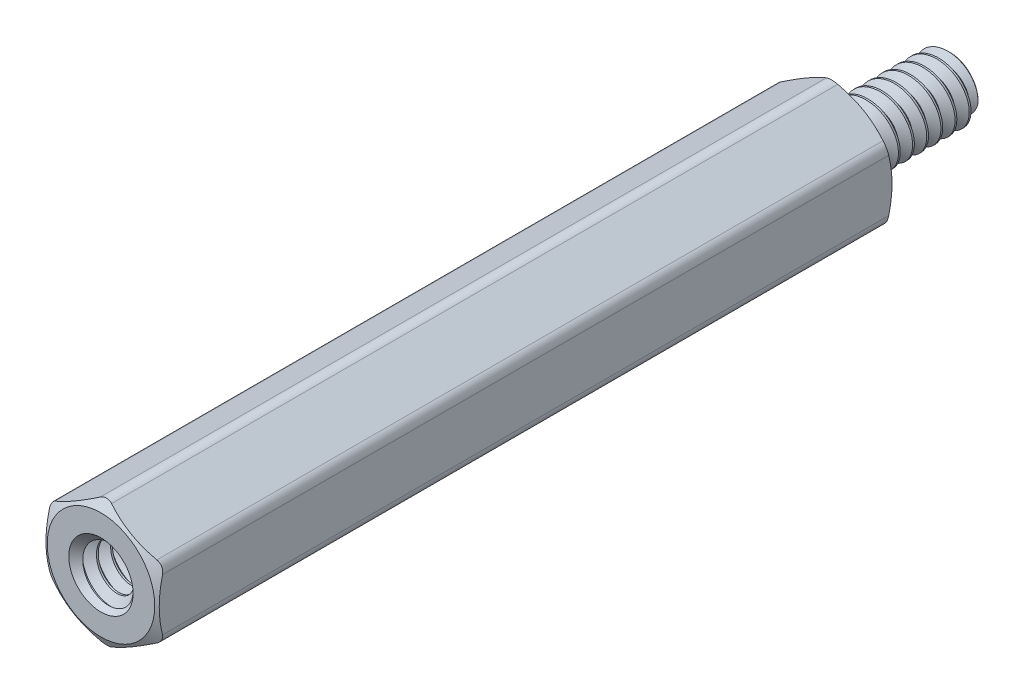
from build123d import *

# Parameters (mm, degrees)
SKETCH4_R              = 2.4638
BOSS_EXTRUDE1_DEPTH    = 41.275
SKETCH5_OUTSIDE_W      = 187.366
SKETCH5_OUTSIDE_H      = 188.348
SKETCH5_OUTSIDE_R      = 3.01625
CUT_EXTRUDE1_DEPTH     = 48.871307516
CUT_EXTRUDE1_DRAFT     = -60
SKETCH6_OUTSIDE_W      = 165.5
SKETCH6_OUTSIDE_H      = 166.482
SKETCH6_OUTSIDE_R      = 3.01625
CUT_EXTRUDE2_DEPTH     = 42.558959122
CUT_EXTRUDE2_DRAFT     = -60
FILLET1_R              = 0.635
CUT_SWEEP1_PITCH       = 0.79375
CUT_SWEEP1_HEIGHT      = 6.1595
CUT_SWEEP1_RADIUS      = 1.7526
CUT_SWEEP1_START_ANGLE = 90
SKETCH9_R              = 1.9510375
BOSS_EXTRUDE2_DEPTH    = 6.35
SKETCH10_W             = 6.35
SKETCH10_H             = 1.7526
CUT_SWEEP2_PITCH       = 0.79375
CUT_SWEEP2_HEIGHT      = 7.14375
CUT_SWEEP2_RADIUS      = 1.7526
CUT_SWEEP2_START_ANGLE = 90


with BuildPart() as part:
    # Sketch3 → Revolve1 (revolve)
    with BuildSketch(Plane(origin=(0, 0, 0), x_dir=(0, 0, -1), z_dir=(1, 0, 0))):
        with BuildLine():
            Line((-34.925, 1.5541625), (-34.925, 0))
            Line((-34.925, 0), (6.35, 0))
            Line((6.35, 0), (6.35, 1.5541625))
            Line((6.35, 1.5541625), (6.1515625, 1.7526))
            Line((6.1515625, 1.7526), (1.05965625, 1.7526))
            Line((1.05965625, 1.7526), (0.762, 1.237044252))
            Line((0.762, 1.237044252), (0.1984375, 1.237044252))
            ThreePointArc((0.1984375, 1.237044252), (0.058120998, 1.29516525), (0, 1.435481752))
            Line((0, 1.435481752), (0, 3.175))
            Line((0, 3.175), (-41.275, 3.175))
            Line((-41.275, 3.175), (-41.275, 1.9510375))
            Line((-41.275, 1.9510375), (-41.0765625, 1.7526))
            Line((-41.0765625, 1.7526), (-35.1234375, 1.7526))
            Line((-35.1234375, 1.7526), (-34.925, 1.5541625))
        make_face()
        with BuildLine():
            Line((-34.925, 1.5541625), (-34.925, 0))
            Line((-34.925, 0), (6.35, 0))
            Line((6.35, 0), (6.35, 1.5541625))
            Line((6.35, 1.5541625), (6.1515625, 1.7526))
            Line((6.1515625, 1.7526), (1.05965625, 1.7526))
            Line((1.05965625, 1.7526), (0.762, 1.237044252))
            Line((0.762, 1.237044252), (0.1984375, 1.237044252))
            ThreePointArc((0.1984375, 1.237044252), (0.058120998, 1.29516525), (0, 1.435481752))
            Line((0, 1.435481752), (0, 3.175))
            Line((0, 3.175), (-41.275, 3.175))
            Line((-41.275, 3.175), (-41.275, 1.9510375))
            Line((-41.275, 1.9510375), (-41.0765625, 1.7526))
            Line((-41.0765625, 1.7526), (-35.1234375, 1.7526))
            Line((-35.1234375, 1.7526), (-34.925, 1.5541625))
        make_face()
    revolve(axis=Axis((0, 0, -6.35), (0, 0, 1)))

    # Sketch4 → Boss-Extrude1 (add)
    with BuildSketch(Plane.XY.offset(41.275)):
        Polygon((-3.175, 1.833087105), (-3.175, -1.833087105), (0, -3.666174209), (3.175, -1.833087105), (3.175, 1.833087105), (0, 3.666174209), align=None)
        Circle(SKETCH4_R, mode=Mode.SUBTRACT)
    extrude(amount=-BOSS_EXTRUDE1_DEPTH)


with BuildPart() as cut_extrude1_tool:
    # Sketch5 outside → Cut-Extrude1 (with draft: the straight prism first)
    with BuildSketch(Plane.XY.offset(41.275)):
        Rectangle(SKETCH5_OUTSIDE_W, SKETCH5_OUTSIDE_H)
        Circle(SKETCH5_OUTSIDE_R, mode=Mode.SUBTRACT)
    extrude(amount=-CUT_EXTRUDE1_DEPTH)
    # Cut-Extrude1: the draft: its side faces are tilted about the plane it starts from
    cut_extrude1_sides = [cut_extrude1_tool.faces().sort_by_distance(p)[0] for p in [
        (0, -94.174, 16.839346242),
        (93.683, 0, 16.839346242),
        (0, 94.174, 16.839346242),
        (-93.683, 0, 16.839346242),
        (-3.01625, 0, 16.839346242),
    ]]
    draft(cut_extrude1_sides, Plane.XY.offset(41.275), CUT_EXTRUDE1_DRAFT)


with BuildPart() as part_1:
    add(part.part)

    # Cut-Extrude1: cut by cut_extrude1_tool
    add(cut_extrude1_tool.part, mode=Mode.SUBTRACT)


with BuildPart() as cut_extrude2_tool:
    # Sketch6 outside → Cut-Extrude2 (with draft: the straight prism first)
    with BuildSketch(Plane(origin=(0, 0, 0), x_dir=(-1, 0, 0), z_dir=(0, 0, -1))):
        Rectangle(SKETCH6_OUTSIDE_W, SKETCH6_OUTSIDE_H)
        Circle(SKETCH6_OUTSIDE_R, mode=Mode.SUBTRACT)
    extrude(amount=-CUT_EXTRUDE2_DEPTH)
    # Cut-Extrude2: the draft: its side faces are tilted about the plane it starts from
    cut_extrude2_sides = [cut_extrude2_tool.faces().sort_by_distance(p)[0] for p in [
        (0, -83.241, 21.279479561),
        (-82.75, 0, 21.279479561),
        (0, 83.241, 21.279479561),
        (82.75, 0, 21.279479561),
        (3.01625, 0, 21.279479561),
    ]]
    draft(cut_extrude2_sides, Plane(origin=(0, 0, 0), x_dir=(-1, 0, 0), z_dir=(0, 0, -1)), CUT_EXTRUDE2_DRAFT)


with BuildPart() as part_2:
    add(part_1.part)

    # Cut-Extrude2: cut by cut_extrude2_tool
    add(cut_extrude2_tool.part, mode=Mode.SUBTRACT)

    # Fillet1
    fillet1_edges = [part_2.edges().sort_by_distance(p)[0] for p in [
        (0, 3.666174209, 20.6375),
        (-3.175, -1.833087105, 20.6375),
        (0, -3.666174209, 20.6375),
        (3.175, -1.833087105, 20.6375),
        (3.175, 1.833087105, 20.6375),
        (-3.175, 1.833087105, 20.6375),
    ]]
    fillet(fillet1_edges, radius=FILLET1_R)

    # Cut-Sweep1: sweep along a helix
    with BuildLine() as cut_sweep1_path:
        add(Helix(CUT_SWEEP1_PITCH, CUT_SWEEP1_HEIGHT, CUT_SWEEP1_RADIUS, center=(0, 0, -6.35), direction=(0, 0, 1), mode=Mode.PRIVATE).rotate(Axis((0, 0, -6.35), (0, 0, 1)), CUT_SWEEP1_START_ANGLE))
    # Sketch7 → Cut-Sweep1 (sweep, cut)
    with BuildSketch(Plane.ZY):
        Polygon((-6.64765625, 1.237044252), (-6.746875, 1.237044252), (-7.069335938, 1.795562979), (-6.325195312, 1.795562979), align=None)
    sweep(path=cut_sweep1_path.line, is_frenet=True, mode=Mode.SUBTRACT)

    # Sketch9 → Boss-Extrude2 (add)
    with BuildSketch(Plane.XY.offset(34.925)):
        Circle(SKETCH9_R)
    extrude(amount=BOSS_EXTRUDE2_DEPTH)


with BuildPart() as body_2:
    # Sketch10 → Revolve2 (revolve)
    with BuildSketch(Plane(origin=(0, 0, 0), x_dir=(0, 0, -1), z_dir=(1, 0, 0))):
        with Locations((-38.1, 0.8763)):
            Rectangle(SKETCH10_W, SKETCH10_H)
    revolve(axis=Axis((0, 0, -6.35), (0, 0, 1)))

    # Cut-Sweep2: sweep along a helix
    with BuildLine() as cut_sweep2_path:
        add(Helix(CUT_SWEEP2_PITCH, CUT_SWEEP2_HEIGHT, CUT_SWEEP2_RADIUS, center=(0, 0, 41.275), direction=(0, 0, -1), mode=Mode.PRIVATE).rotate(Axis((0, 0, 41.275), (0, 0, -1)), CUT_SWEEP2_START_ANGLE))
    # Sketch12 → Cut-Sweep2 (sweep, cut)
    with BuildSketch(Plane(origin=(0, 0, 0), x_dir=(0, 0, -1), z_dir=(1, 0, 0))):
        Polygon((-41.671875, 1.237044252), (-41.57265625, 1.237044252), (-41.250195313, 1.795562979), (-41.994335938, 1.795562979), align=None)
    sweep(path=cut_sweep2_path.line, is_frenet=True, mode=Mode.SUBTRACT)


with BuildPart() as part_3:
    add(part_2.part)

    # Combine1: cut body 2
    add(body_2.part, mode=Mode.SUBTRACT)

    # Cut-Extrude3 cone 1 section (on through the dimple's axis) → Cut-Extrude3 (revolve, cut)
    with BuildSketch(Plane(origin=(0, 0, 41.275), x_dir=(0, -1, 0), z_dir=(1, 0, 0))):
        Polygon((0, 0), (1.8034, 0), (0, 1.8034), align=None)
    revolve(axis=Axis((0, 0, 41.275), (0, 0, -1)), mode=Mode.SUBTRACT)


solid = part_3.part
